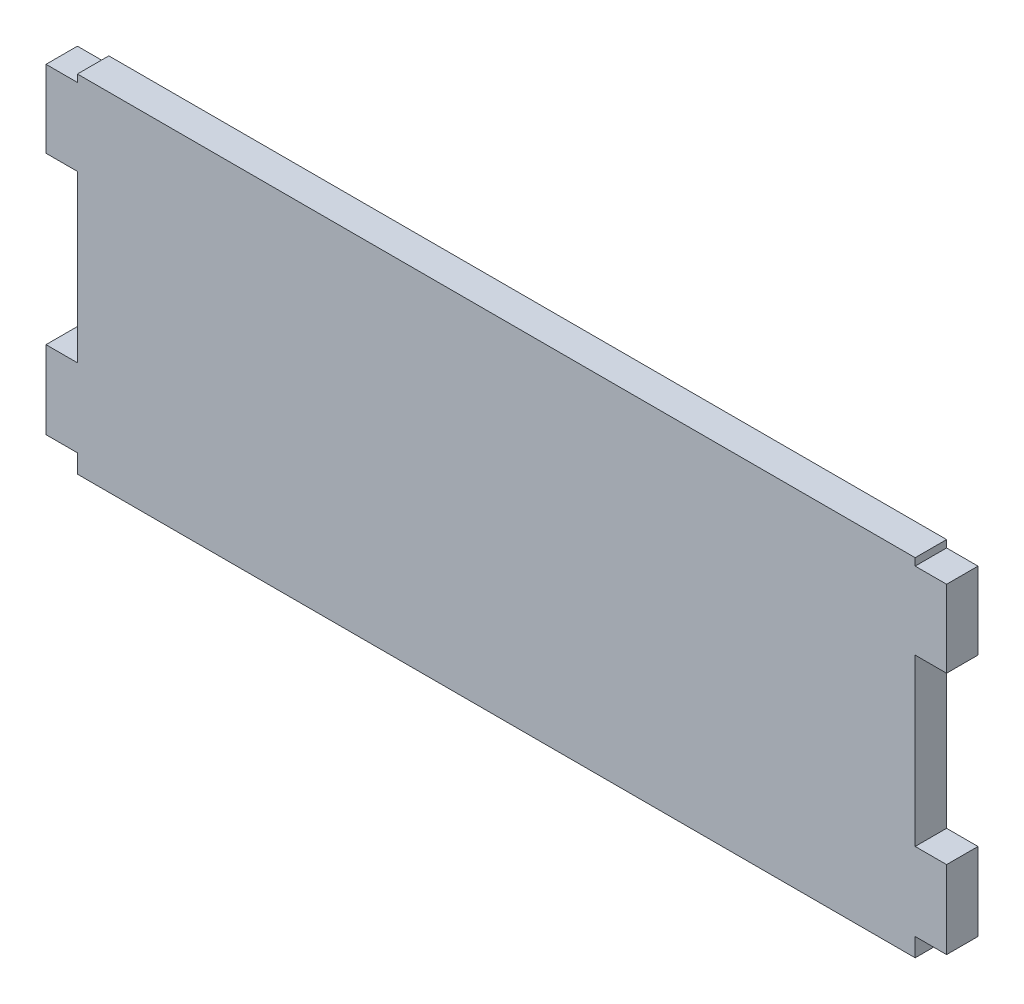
ISO-10303-21;
HEADER;
FILE_DESCRIPTION(('STEP AP214'),'2;1');
FILE_NAME('part.step','',(''),(''),'','','');
FILE_SCHEMA(('AUTOMOTIVE_DESIGN { 1 0 10303 214 1 1 1 1 }'));
ENDSEC;
DATA;
#1=APPLICATION_CONTEXT('core data for automotive mechanical design processes');
#2=APPLICATION_PROTOCOL_DEFINITION('international standard','automotive_design',2000,#1);
#3=PRODUCT_CONTEXT('',#1,'mechanical');
#4=PRODUCT('Part','Part','',(#3));
#5=PRODUCT_RELATED_PRODUCT_CATEGORY('part','',(#4));
#6=PRODUCT_DEFINITION_FORMATION('','',#4);
#7=PRODUCT_DEFINITION_CONTEXT('part definition',#1,'design');
#8=PRODUCT_DEFINITION('design','',#6,#7);
#9=PRODUCT_DEFINITION_SHAPE('','',#8);
#10=(LENGTH_UNIT() NAMED_UNIT(*) SI_UNIT(.MILLI.,.METRE.));
#11=(NAMED_UNIT(*) PLANE_ANGLE_UNIT() SI_UNIT($,.RADIAN.));
#12=(NAMED_UNIT(*) SI_UNIT($,.STERADIAN.) SOLID_ANGLE_UNIT());
#13=UNCERTAINTY_MEASURE_WITH_UNIT(LENGTH_MEASURE(1.E-05),#10,'distance_accuracy_value','');
#14=(GEOMETRIC_REPRESENTATION_CONTEXT(3) GLOBAL_UNCERTAINTY_ASSIGNED_CONTEXT((#13)) GLOBAL_UNIT_ASSIGNED_CONTEXT((#10,
#11,#12)) REPRESENTATION_CONTEXT('',''));
#15=CARTESIAN_POINT('',(0.,0.,0.));
#16=DIRECTION('',(0.,0.,1.));
#17=DIRECTION('',(1.,0.,0.));
#18=AXIS2_PLACEMENT_3D('',#15,#16,#17);
#19=CARTESIAN_POINT('',(80.,-4.59136911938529,3.));
#20=DIRECTION('',(-1.,0.,0.));
#21=DIRECTION('',(0.,0.,1.));
#22=AXIS2_PLACEMENT_3D('',#19,#20,#21);
#23=PLANE('',#22);
#24=DIRECTION('',(0.,1.,0.));
#25=VECTOR('',#24,1.);
#26=CARTESIAN_POINT('',(80.,-4.59136911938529,3.));
#27=LINE('',#26,#25);
#28=CARTESIAN_POINT('',(80.,-5.28863512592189,3.));
#29=VERTEX_POINT('',#28);
#30=CARTESIAN_POINT('',(80.,-4.59136911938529,3.));
#31=VERTEX_POINT('',#30);
#32=EDGE_CURVE('E37',#29,#31,#27,.T.);
#33=ORIENTED_EDGE('',*,*,#32,.F.);
#34=DIRECTION('',(0.,0.,1.));
#35=VECTOR('',#34,1.);
#36=CARTESIAN_POINT('',(80.,-5.28863512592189,0.));
#37=LINE('',#36,#35);
#38=CARTESIAN_POINT('',(80.,-5.28863512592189,0.));
#39=VERTEX_POINT('',#38);
#40=EDGE_CURVE('E185',#39,#29,#37,.T.);
#41=ORIENTED_EDGE('',*,*,#40,.F.);
#42=DIRECTION('',(0.,1.,0.));
#43=VECTOR('',#42,1.);
#44=CARTESIAN_POINT('',(80.,-4.59136911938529,0.));
#45=LINE('',#44,#43);
#46=CARTESIAN_POINT('',(80.,-4.59136911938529,0.));
#47=VERTEX_POINT('',#46);
#48=EDGE_CURVE('E174',#39,#47,#45,.T.);
#49=ORIENTED_EDGE('',*,*,#48,.T.);
#50=DIRECTION('',(0.,0.,-1.));
#51=VECTOR('',#50,1.);
#52=CARTESIAN_POINT('',(80.,-4.59136911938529,3.));
#53=LINE('',#52,#51);
#54=EDGE_CURVE('E314',#31,#47,#53,.T.);
#55=ORIENTED_EDGE('',*,*,#54,.F.);
#56=EDGE_LOOP('',(#33,#41,#49,#55));
#57=FACE_BOUND('',#56,.T.);
#58=ADVANCED_FACE('F33',(#57),#23,.F.);
#59=CARTESIAN_POINT('',(80.,-28.4735574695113,0.));
#60=VERTEX_POINT('',#59);
#61=CARTESIAN_POINT('',(80.,-12.6479913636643,0.));
#62=VERTEX_POINT('',#61);
#63=EDGE_CURVE('E183',#60,#62,#45,.T.);
#64=ORIENTED_EDGE('',*,*,#63,.T.);
#65=DIRECTION('',(0.,0.,1.));
#66=VECTOR('',#65,1.);
#67=CARTESIAN_POINT('',(80.,-12.6479913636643,0.));
#68=LINE('',#67,#66);
#69=CARTESIAN_POINT('',(80.,-12.6479913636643,3.));
#70=VERTEX_POINT('',#69);
#71=EDGE_CURVE('E58',#62,#70,#68,.T.);
#72=ORIENTED_EDGE('',*,*,#71,.T.);
#73=CARTESIAN_POINT('',(80.,-28.4735574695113,3.));
#74=VERTEX_POINT('',#73);
#75=EDGE_CURVE('E297',#74,#70,#27,.T.);
#76=ORIENTED_EDGE('',*,*,#75,.F.);
#77=DIRECTION('',(0.,0.,1.));
#78=VECTOR('',#77,1.);
#79=CARTESIAN_POINT('',(80.,-28.4735574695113,0.));
#80=LINE('',#79,#78);
#81=EDGE_CURVE('E215',#60,#74,#80,.T.);
#82=ORIENTED_EDGE('',*,*,#81,.F.);
#83=EDGE_LOOP('',(#64,#72,#76,#82));
#84=FACE_BOUND('',#83,.T.);
#85=ADVANCED_FACE('F329',(#84),#23,.F.);
#86=CARTESIAN_POINT('',(0.,-4.59136911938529,3.));
#87=DIRECTION('',(1.,0.,0.));
#88=DIRECTION('',(0.,0.,-1.));
#89=AXIS2_PLACEMENT_3D('',#86,#87,#88);
#90=PLANE('',#89);
#91=DIRECTION('',(0.,-1.,0.));
#92=VECTOR('',#91,1.);
#93=CARTESIAN_POINT('',(0.,-4.59136911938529,3.));
#94=LINE('',#93,#92);
#95=CARTESIAN_POINT('',(0.,-35.9200211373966,3.));
#96=VERTEX_POINT('',#95);
#97=CARTESIAN_POINT('',(0.,-37.6851798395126,3.));
#98=VERTEX_POINT('',#97);
#99=EDGE_CURVE('E263',#96,#98,#94,.T.);
#100=ORIENTED_EDGE('',*,*,#99,.F.);
#101=DIRECTION('',(0.,0.,1.));
#102=VECTOR('',#101,1.);
#103=CARTESIAN_POINT('',(0.,-35.9200211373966,0.));
#104=LINE('',#103,#102);
#105=CARTESIAN_POINT('',(0.,-35.9200211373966,0.));
#106=VERTEX_POINT('',#105);
#107=EDGE_CURVE('E374',#106,#96,#104,.T.);
#108=ORIENTED_EDGE('',*,*,#107,.F.);
#109=DIRECTION('',(0.,-1.,0.));
#110=VECTOR('',#109,1.);
#111=CARTESIAN_POINT('',(0.,-4.59136911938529,0.));
#112=LINE('',#111,#110);
#113=CARTESIAN_POINT('',(0.,-37.6851798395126,0.));
#114=VERTEX_POINT('',#113);
#115=EDGE_CURVE('E267',#106,#114,#112,.T.);
#116=ORIENTED_EDGE('',*,*,#115,.T.);
#117=DIRECTION('',(0.,0.,-1.));
#118=VECTOR('',#117,1.);
#119=CARTESIAN_POINT('',(0.,-37.6851798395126,3.));
#120=LINE('',#119,#118);
#121=EDGE_CURVE('E11',#98,#114,#120,.T.);
#122=ORIENTED_EDGE('',*,*,#121,.F.);
#123=EDGE_LOOP('',(#100,#108,#116,#122));
#124=FACE_BOUND('',#123,.T.);
#125=ADVANCED_FACE('F349',(#124),#90,.F.);
#126=CARTESIAN_POINT('',(0.,-12.6479913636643,0.));
#127=VERTEX_POINT('',#126);
#128=CARTESIAN_POINT('',(0.,-28.4735574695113,0.));
#129=VERTEX_POINT('',#128);
#130=EDGE_CURVE('E283',#127,#129,#112,.T.);
#131=ORIENTED_EDGE('',*,*,#130,.T.);
#132=DIRECTION('',(0.,0.,1.));
#133=VECTOR('',#132,1.);
#134=CARTESIAN_POINT('',(0.,-28.4735574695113,0.));
#135=LINE('',#134,#133);
#136=CARTESIAN_POINT('',(0.,-28.4735574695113,3.));
#137=VERTEX_POINT('',#136);
#138=EDGE_CURVE('E399',#129,#137,#135,.T.);
#139=ORIENTED_EDGE('',*,*,#138,.T.);
#140=CARTESIAN_POINT('',(0.,-12.6479913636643,3.));
#141=VERTEX_POINT('',#140);
#142=EDGE_CURVE('E266',#141,#137,#94,.T.);
#143=ORIENTED_EDGE('',*,*,#142,.F.);
#144=DIRECTION('',(0.,0.,1.));
#145=VECTOR('',#144,1.);
#146=CARTESIAN_POINT('',(0.,-12.6479913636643,0.));
#147=LINE('',#146,#145);
#148=EDGE_CURVE('E414',#127,#141,#147,.T.);
#149=ORIENTED_EDGE('',*,*,#148,.F.);
#150=EDGE_LOOP('',(#131,#139,#143,#149));
#151=FACE_BOUND('',#150,.T.);
#152=ADVANCED_FACE('F361',(#151),#90,.F.);
#153=CARTESIAN_POINT('',(0.,-4.59136911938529,0.));
#154=VERTEX_POINT('',#153);
#155=CARTESIAN_POINT('',(0.,-5.28863512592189,0.));
#156=VERTEX_POINT('',#155);
#157=EDGE_CURVE('E285',#154,#156,#112,.T.);
#158=ORIENTED_EDGE('',*,*,#157,.T.);
#159=DIRECTION('',(0.,0.,1.));
#160=VECTOR('',#159,1.);
#161=CARTESIAN_POINT('',(0.,-5.28863512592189,0.));
#162=LINE('',#161,#160);
#163=CARTESIAN_POINT('',(0.,-5.28863512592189,3.));
#164=VERTEX_POINT('',#163);
#165=EDGE_CURVE('E420',#156,#164,#162,.T.);
#166=ORIENTED_EDGE('',*,*,#165,.T.);
#167=CARTESIAN_POINT('',(0.,-4.59136911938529,3.));
#168=VERTEX_POINT('',#167);
#169=EDGE_CURVE('E280',#168,#164,#94,.T.);
#170=ORIENTED_EDGE('',*,*,#169,.F.);
#171=DIRECTION('',(0.,0.,-1.));
#172=VECTOR('',#171,1.);
#173=CARTESIAN_POINT('',(0.,-4.59136911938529,3.));
#174=LINE('',#173,#172);
#175=EDGE_CURVE('E291',#168,#154,#174,.T.);
#176=ORIENTED_EDGE('',*,*,#175,.T.);
#177=EDGE_LOOP('',(#158,#166,#170,#176));
#178=FACE_BOUND('',#177,.T.);
#179=ADVANCED_FACE('F35',(#178),#90,.F.);
#180=CARTESIAN_POINT('',(0.,-37.6851798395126,3.));
#181=DIRECTION('',(0.,1.,0.));
#182=DIRECTION('',(0.,0.,1.));
#183=AXIS2_PLACEMENT_3D('',#180,#181,#182);
#184=PLANE('',#183);
#185=DIRECTION('',(1.,0.,0.));
#186=VECTOR('',#185,1.);
#187=CARTESIAN_POINT('',(0.,-37.6851798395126,0.));
#188=LINE('',#187,#186);
#189=CARTESIAN_POINT('',(80.,-37.6851798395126,0.));
#190=VERTEX_POINT('',#189);
#191=EDGE_CURVE('E184',#114,#190,#188,.T.);
#192=ORIENTED_EDGE('',*,*,#191,.T.);
#193=DIRECTION('',(0.,0.,-1.));
#194=VECTOR('',#193,1.);
#195=CARTESIAN_POINT('',(80.,-37.6851798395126,3.));
#196=LINE('',#195,#194);
#197=CARTESIAN_POINT('',(80.,-37.6851798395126,3.));
#198=VERTEX_POINT('',#197);
#199=EDGE_CURVE('E43',#198,#190,#196,.T.);
#200=ORIENTED_EDGE('',*,*,#199,.F.);
#201=DIRECTION('',(1.,0.,0.));
#202=VECTOR('',#201,1.);
#203=CARTESIAN_POINT('',(0.,-37.6851798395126,3.));
#204=LINE('',#203,#202);
#205=EDGE_CURVE('E274',#98,#198,#204,.T.);
#206=ORIENTED_EDGE('',*,*,#205,.F.);
#207=ORIENTED_EDGE('',*,*,#121,.T.);
#208=EDGE_LOOP('',(#192,#200,#206,#207));
#209=FACE_BOUND('',#208,.T.);
#210=ADVANCED_FACE('F310',(#209),#184,.F.);
#211=CARTESIAN_POINT('',(80.,-35.9200211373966,0.));
#212=VERTEX_POINT('',#211);
#213=EDGE_CURVE('E260',#190,#212,#45,.T.);
#214=ORIENTED_EDGE('',*,*,#213,.T.);
#215=DIRECTION('',(0.,0.,1.));
#216=VECTOR('',#215,1.);
#217=CARTESIAN_POINT('',(80.,-35.9200211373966,0.));
#218=LINE('',#217,#216);
#219=CARTESIAN_POINT('',(80.,-35.9200211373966,3.));
#220=VERTEX_POINT('',#219);
#221=EDGE_CURVE('E227',#212,#220,#218,.T.);
#222=ORIENTED_EDGE('',*,*,#221,.T.);
#223=EDGE_CURVE('E292',#198,#220,#27,.T.);
#224=ORIENTED_EDGE('',*,*,#223,.F.);
#225=ORIENTED_EDGE('',*,*,#199,.T.);
#226=EDGE_LOOP('',(#214,#222,#224,#225));
#227=FACE_BOUND('',#226,.T.);
#228=ADVANCED_FACE('F316',(#227),#23,.F.);
#229=CARTESIAN_POINT('',(0.,-4.59136911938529,3.));
#230=DIRECTION('',(0.,-1.,0.));
#231=DIRECTION('',(0.,0.,-1.));
#232=AXIS2_PLACEMENT_3D('',#229,#230,#231);
#233=PLANE('',#232);
#234=DIRECTION('',(-1.,0.,0.));
#235=VECTOR('',#234,1.);
#236=CARTESIAN_POINT('',(0.,-4.59136911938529,0.));
#237=LINE('',#236,#235);
#238=EDGE_CURVE('E181',#47,#154,#237,.T.);
#239=ORIENTED_EDGE('',*,*,#238,.T.);
#240=ORIENTED_EDGE('',*,*,#175,.F.);
#241=DIRECTION('',(-1.,0.,0.));
#242=VECTOR('',#241,1.);
#243=CARTESIAN_POINT('',(0.,-4.59136911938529,3.));
#244=LINE('',#243,#242);
#245=EDGE_CURVE('E288',#31,#168,#244,.T.);
#246=ORIENTED_EDGE('',*,*,#245,.F.);
#247=ORIENTED_EDGE('',*,*,#54,.T.);
#248=EDGE_LOOP('',(#239,#240,#246,#247));
#249=FACE_BOUND('',#248,.T.);
#250=ADVANCED_FACE('F352',(#249),#233,.F.);
#251=CARTESIAN_POINT('',(0.,0.,3.));
#252=DIRECTION('',(0.,0.,1.));
#253=DIRECTION('',(1.,0.,0.));
#254=AXIS2_PLACEMENT_3D('',#251,#252,#253);
#255=PLANE('',#254);
#256=ORIENTED_EDGE('',*,*,#169,.T.);
#257=DIRECTION('',(-1.,0.,0.));
#258=VECTOR('',#257,1.);
#259=CARTESIAN_POINT('',(0.,-5.28863512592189,3.));
#260=LINE('',#259,#258);
#261=CARTESIAN_POINT('',(-3.,-5.28863512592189,3.));
#262=VERTEX_POINT('',#261);
#263=EDGE_CURVE('E382',#164,#262,#260,.T.);
#264=ORIENTED_EDGE('',*,*,#263,.T.);
#265=DIRECTION('',(0.,-1.,0.));
#266=VECTOR('',#265,1.);
#267=CARTESIAN_POINT('',(-3.,-5.28863512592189,3.));
#268=LINE('',#267,#266);
#269=CARTESIAN_POINT('',(-3.,-12.6479913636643,3.));
#270=VERTEX_POINT('',#269);
#271=EDGE_CURVE('E406',#262,#270,#268,.T.);
#272=ORIENTED_EDGE('',*,*,#271,.T.);
#273=DIRECTION('',(1.,0.,0.));
#274=VECTOR('',#273,1.);
#275=CARTESIAN_POINT('',(0.,-12.6479913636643,3.));
#276=LINE('',#275,#274);
#277=EDGE_CURVE('E409',#270,#141,#276,.T.);
#278=ORIENTED_EDGE('',*,*,#277,.T.);
#279=ORIENTED_EDGE('',*,*,#142,.T.);
#280=DIRECTION('',(-1.,0.,0.));
#281=VECTOR('',#280,1.);
#282=CARTESIAN_POINT('',(0.,-28.4735574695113,3.));
#283=LINE('',#282,#281);
#284=CARTESIAN_POINT('',(-3.,-28.4735574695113,3.));
#285=VERTEX_POINT('',#284);
#286=EDGE_CURVE('E224',#137,#285,#283,.T.);
#287=ORIENTED_EDGE('',*,*,#286,.T.);
#288=DIRECTION('',(0.,-1.,0.));
#289=VECTOR('',#288,1.);
#290=CARTESIAN_POINT('',(-3.,-28.4735574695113,3.));
#291=LINE('',#290,#289);
#292=CARTESIAN_POINT('',(-3.,-35.9200211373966,3.));
#293=VERTEX_POINT('',#292);
#294=EDGE_CURVE('E388',#285,#293,#291,.T.);
#295=ORIENTED_EDGE('',*,*,#294,.T.);
#296=DIRECTION('',(1.,0.,0.));
#297=VECTOR('',#296,1.);
#298=CARTESIAN_POINT('',(0.,-35.9200211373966,3.));
#299=LINE('',#298,#297);
#300=EDGE_CURVE('E379',#293,#96,#299,.T.);
#301=ORIENTED_EDGE('',*,*,#300,.T.);
#302=ORIENTED_EDGE('',*,*,#99,.T.);
#303=ORIENTED_EDGE('',*,*,#205,.T.);
#304=ORIENTED_EDGE('',*,*,#223,.T.);
#305=DIRECTION('',(1.,0.,0.));
#306=VECTOR('',#305,1.);
#307=CARTESIAN_POINT('',(80.,-35.9200211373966,3.));
#308=LINE('',#307,#306);
#309=CARTESIAN_POINT('',(83.,-35.9200211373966,3.));
#310=VERTEX_POINT('',#309);
#311=EDGE_CURVE('E221',#220,#310,#308,.T.);
#312=ORIENTED_EDGE('',*,*,#311,.T.);
#313=DIRECTION('',(0.,1.,0.));
#314=VECTOR('',#313,1.);
#315=CARTESIAN_POINT('',(83.,-28.4735574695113,3.));
#316=LINE('',#315,#314);
#317=CARTESIAN_POINT('',(83.,-28.4735574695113,3.));
#318=VERTEX_POINT('',#317);
#319=EDGE_CURVE('E217',#310,#318,#316,.T.);
#320=ORIENTED_EDGE('',*,*,#319,.T.);
#321=DIRECTION('',(-1.,0.,0.));
#322=VECTOR('',#321,1.);
#323=CARTESIAN_POINT('',(80.,-28.4735574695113,3.));
#324=LINE('',#323,#322);
#325=EDGE_CURVE('E208',#318,#74,#324,.T.);
#326=ORIENTED_EDGE('',*,*,#325,.T.);
#327=ORIENTED_EDGE('',*,*,#75,.T.);
#328=DIRECTION('',(1.,0.,0.));
#329=VECTOR('',#328,1.);
#330=CARTESIAN_POINT('',(80.,-12.6479913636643,3.));
#331=LINE('',#330,#329);
#332=CARTESIAN_POINT('',(83.,-12.6479913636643,3.));
#333=VERTEX_POINT('',#332);
#334=EDGE_CURVE('E199',#70,#333,#331,.T.);
#335=ORIENTED_EDGE('',*,*,#334,.T.);
#336=DIRECTION('',(0.,1.,0.));
#337=VECTOR('',#336,1.);
#338=CARTESIAN_POINT('',(83.,-5.28863512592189,3.));
#339=LINE('',#338,#337);
#340=CARTESIAN_POINT('',(83.,-5.28863512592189,3.));
#341=VERTEX_POINT('',#340);
#342=EDGE_CURVE('E194',#333,#341,#339,.T.);
#343=ORIENTED_EDGE('',*,*,#342,.T.);
#344=DIRECTION('',(-1.,0.,0.));
#345=VECTOR('',#344,1.);
#346=CARTESIAN_POINT('',(80.,-5.28863512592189,3.));
#347=LINE('',#346,#345);
#348=EDGE_CURVE('E203',#341,#29,#347,.T.);
#349=ORIENTED_EDGE('',*,*,#348,.T.);
#350=ORIENTED_EDGE('',*,*,#32,.T.);
#351=ORIENTED_EDGE('',*,*,#245,.T.);
#352=EDGE_LOOP('',(#256,#264,#272,#278,#279,#287,#295,#301,#302,#303,#304,#312,#320,#326,#327,
#335,#343,#349,#350,#351));
#353=FACE_BOUND('',#352,.T.);
#354=ADVANCED_FACE('F305',(#353),#255,.T.);
#355=CARTESIAN_POINT('',(0.,0.,0.));
#356=DIRECTION('',(0.,0.,1.));
#357=DIRECTION('',(1.,0.,0.));
#358=AXIS2_PLACEMENT_3D('',#355,#356,#357);
#359=PLANE('',#358);
#360=ORIENTED_EDGE('',*,*,#157,.F.);
#361=ORIENTED_EDGE('',*,*,#238,.F.);
#362=ORIENTED_EDGE('',*,*,#48,.F.);
#363=DIRECTION('',(-1.,0.,0.));
#364=VECTOR('',#363,1.);
#365=CARTESIAN_POINT('',(80.,-5.28863512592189,0.));
#366=LINE('',#365,#364);
#367=CARTESIAN_POINT('',(83.,-5.28863512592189,0.));
#368=VERTEX_POINT('',#367);
#369=EDGE_CURVE('E179',#368,#39,#366,.T.);
#370=ORIENTED_EDGE('',*,*,#369,.F.);
#371=DIRECTION('',(0.,1.,0.));
#372=VECTOR('',#371,1.);
#373=CARTESIAN_POINT('',(83.,-5.28863512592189,0.));
#374=LINE('',#373,#372);
#375=CARTESIAN_POINT('',(83.,-12.6479913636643,0.));
#376=VERTEX_POINT('',#375);
#377=EDGE_CURVE('E189',#376,#368,#374,.T.);
#378=ORIENTED_EDGE('',*,*,#377,.F.);
#379=DIRECTION('',(1.,0.,0.));
#380=VECTOR('',#379,1.);
#381=CARTESIAN_POINT('',(80.,-12.6479913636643,0.));
#382=LINE('',#381,#380);
#383=EDGE_CURVE('E193',#62,#376,#382,.T.);
#384=ORIENTED_EDGE('',*,*,#383,.F.);
#385=ORIENTED_EDGE('',*,*,#63,.F.);
#386=DIRECTION('',(-1.,0.,0.));
#387=VECTOR('',#386,1.);
#388=CARTESIAN_POINT('',(80.,-28.4735574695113,0.));
#389=LINE('',#388,#387);
#390=CARTESIAN_POINT('',(83.,-28.4735574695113,0.));
#391=VERTEX_POINT('',#390);
#392=EDGE_CURVE('E220',#391,#60,#389,.T.);
#393=ORIENTED_EDGE('',*,*,#392,.F.);
#394=DIRECTION('',(0.,1.,0.));
#395=VECTOR('',#394,1.);
#396=CARTESIAN_POINT('',(83.,-28.4735574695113,0.));
#397=LINE('',#396,#395);
#398=CARTESIAN_POINT('',(83.,-35.9200211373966,0.));
#399=VERTEX_POINT('',#398);
#400=EDGE_CURVE('E212',#399,#391,#397,.T.);
#401=ORIENTED_EDGE('',*,*,#400,.F.);
#402=DIRECTION('',(1.,0.,0.));
#403=VECTOR('',#402,1.);
#404=CARTESIAN_POINT('',(80.,-35.9200211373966,0.));
#405=LINE('',#404,#403);
#406=EDGE_CURVE('E216',#212,#399,#405,.T.);
#407=ORIENTED_EDGE('',*,*,#406,.F.);
#408=ORIENTED_EDGE('',*,*,#213,.F.);
#409=ORIENTED_EDGE('',*,*,#191,.F.);
#410=ORIENTED_EDGE('',*,*,#115,.F.);
#411=DIRECTION('',(1.,0.,0.));
#412=VECTOR('',#411,1.);
#413=CARTESIAN_POINT('',(0.,-35.9200211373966,0.));
#414=LINE('',#413,#412);
#415=CARTESIAN_POINT('',(-3.,-35.9200211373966,0.));
#416=VERTEX_POINT('',#415);
#417=EDGE_CURVE('E381',#416,#106,#414,.T.);
#418=ORIENTED_EDGE('',*,*,#417,.F.);
#419=DIRECTION('',(0.,-1.,0.));
#420=VECTOR('',#419,1.);
#421=CARTESIAN_POINT('',(-3.,-28.4735574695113,0.));
#422=LINE('',#421,#420);
#423=CARTESIAN_POINT('',(-3.,-28.4735574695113,0.));
#424=VERTEX_POINT('',#423);
#425=EDGE_CURVE('E392',#424,#416,#422,.T.);
#426=ORIENTED_EDGE('',*,*,#425,.F.);
#427=DIRECTION('',(-1.,0.,0.));
#428=VECTOR('',#427,1.);
#429=CARTESIAN_POINT('',(0.,-28.4735574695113,0.));
#430=LINE('',#429,#428);
#431=EDGE_CURVE('E389',#129,#424,#430,.T.);
#432=ORIENTED_EDGE('',*,*,#431,.F.);
#433=ORIENTED_EDGE('',*,*,#130,.F.);
#434=DIRECTION('',(1.,0.,0.));
#435=VECTOR('',#434,1.);
#436=CARTESIAN_POINT('',(0.,-12.6479913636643,0.));
#437=LINE('',#436,#435);
#438=CARTESIAN_POINT('',(-3.,-12.6479913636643,0.));
#439=VERTEX_POINT('',#438);
#440=EDGE_CURVE('E404',#439,#127,#437,.T.);
#441=ORIENTED_EDGE('',*,*,#440,.F.);
#442=DIRECTION('',(0.,-1.,0.));
#443=VECTOR('',#442,1.);
#444=CARTESIAN_POINT('',(-3.,-5.28863512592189,0.));
#445=LINE('',#444,#443);
#446=CARTESIAN_POINT('',(-3.,-5.28863512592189,0.));
#447=VERTEX_POINT('',#446);
#448=EDGE_CURVE('E401',#447,#439,#445,.T.);
#449=ORIENTED_EDGE('',*,*,#448,.F.);
#450=DIRECTION('',(-1.,0.,0.));
#451=VECTOR('',#450,1.);
#452=CARTESIAN_POINT('',(0.,-5.28863512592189,0.));
#453=LINE('',#452,#451);
#454=EDGE_CURVE('E405',#156,#447,#453,.T.);
#455=ORIENTED_EDGE('',*,*,#454,.F.);
#456=EDGE_LOOP('',(#360,#361,#362,#370,#378,#384,#385,#393,#401,#407,#408,#409,#410,#418,#426,
#432,#433,#441,#449,#455));
#457=FACE_BOUND('',#456,.T.);
#458=ADVANCED_FACE('F176',(#457),#359,.F.);
#459=CARTESIAN_POINT('',(0.,-12.6479913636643,0.));
#460=DIRECTION('',(0.,-1.,0.));
#461=DIRECTION('',(0.,0.,-1.));
#462=AXIS2_PLACEMENT_3D('',#459,#460,#461);
#463=PLANE('',#462);
#464=ORIENTED_EDGE('',*,*,#277,.F.);
#465=DIRECTION('',(0.,0.,1.));
#466=VECTOR('',#465,1.);
#467=CARTESIAN_POINT('',(-3.,-12.6479913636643,0.));
#468=LINE('',#467,#466);
#469=EDGE_CURVE('E412',#439,#270,#468,.T.);
#470=ORIENTED_EDGE('',*,*,#469,.F.);
#471=ORIENTED_EDGE('',*,*,#440,.T.);
#472=ORIENTED_EDGE('',*,*,#148,.T.);
#473=EDGE_LOOP('',(#464,#470,#471,#472));
#474=FACE_BOUND('',#473,.T.);
#475=ADVANCED_FACE('F448',(#474),#463,.T.);
#476=CARTESIAN_POINT('',(-3.,-5.28863512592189,0.));
#477=DIRECTION('',(-1.,0.,0.));
#478=DIRECTION('',(0.,0.,1.));
#479=AXIS2_PLACEMENT_3D('',#476,#477,#478);
#480=PLANE('',#479);
#481=ORIENTED_EDGE('',*,*,#271,.F.);
#482=DIRECTION('',(0.,0.,1.));
#483=VECTOR('',#482,1.);
#484=CARTESIAN_POINT('',(-3.,-5.28863512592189,0.));
#485=LINE('',#484,#483);
#486=EDGE_CURVE('E434',#447,#262,#485,.T.);
#487=ORIENTED_EDGE('',*,*,#486,.F.);
#488=ORIENTED_EDGE('',*,*,#448,.T.);
#489=ORIENTED_EDGE('',*,*,#469,.T.);
#490=EDGE_LOOP('',(#481,#487,#488,#489));
#491=FACE_BOUND('',#490,.T.);
#492=ADVANCED_FACE('F446',(#491),#480,.T.);
#493=CARTESIAN_POINT('',(0.,-5.28863512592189,0.));
#494=DIRECTION('',(0.,1.,0.));
#495=DIRECTION('',(0.,0.,1.));
#496=AXIS2_PLACEMENT_3D('',#493,#494,#495);
#497=PLANE('',#496);
#498=ORIENTED_EDGE('',*,*,#263,.F.);
#499=ORIENTED_EDGE('',*,*,#165,.F.);
#500=ORIENTED_EDGE('',*,*,#454,.T.);
#501=ORIENTED_EDGE('',*,*,#486,.T.);
#502=EDGE_LOOP('',(#498,#499,#500,#501));
#503=FACE_BOUND('',#502,.T.);
#504=ADVANCED_FACE('F439',(#503),#497,.T.);
#505=CARTESIAN_POINT('',(0.,-35.9200211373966,0.));
#506=DIRECTION('',(0.,-1.,0.));
#507=DIRECTION('',(0.,0.,-1.));
#508=AXIS2_PLACEMENT_3D('',#505,#506,#507);
#509=PLANE('',#508);
#510=ORIENTED_EDGE('',*,*,#300,.F.);
#511=DIRECTION('',(0.,0.,1.));
#512=VECTOR('',#511,1.);
#513=CARTESIAN_POINT('',(-3.,-35.9200211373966,0.));
#514=LINE('',#513,#512);
#515=EDGE_CURVE('E383',#416,#293,#514,.T.);
#516=ORIENTED_EDGE('',*,*,#515,.F.);
#517=ORIENTED_EDGE('',*,*,#417,.T.);
#518=ORIENTED_EDGE('',*,*,#107,.T.);
#519=EDGE_LOOP('',(#510,#516,#517,#518));
#520=FACE_BOUND('',#519,.T.);
#521=ADVANCED_FACE('F378',(#520),#509,.T.);
#522=CARTESIAN_POINT('',(-3.,-28.4735574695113,0.));
#523=DIRECTION('',(-1.,0.,0.));
#524=DIRECTION('',(0.,-1.,0.));
#525=AXIS2_PLACEMENT_3D('',#522,#523,#524);
#526=PLANE('',#525);
#527=ORIENTED_EDGE('',*,*,#294,.F.);
#528=DIRECTION('',(0.,0.,1.));
#529=VECTOR('',#528,1.);
#530=CARTESIAN_POINT('',(-3.,-28.4735574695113,0.));
#531=LINE('',#530,#529);
#532=EDGE_CURVE('E397',#424,#285,#531,.T.);
#533=ORIENTED_EDGE('',*,*,#532,.F.);
#534=ORIENTED_EDGE('',*,*,#425,.T.);
#535=ORIENTED_EDGE('',*,*,#515,.T.);
#536=EDGE_LOOP('',(#527,#533,#534,#535));
#537=FACE_BOUND('',#536,.T.);
#538=ADVANCED_FACE('F460',(#537),#526,.T.);
#539=CARTESIAN_POINT('',(0.,-28.4735574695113,0.));
#540=DIRECTION('',(0.,1.,0.));
#541=DIRECTION('',(0.,0.,1.));
#542=AXIS2_PLACEMENT_3D('',#539,#540,#541);
#543=PLANE('',#542);
#544=ORIENTED_EDGE('',*,*,#286,.F.);
#545=ORIENTED_EDGE('',*,*,#138,.F.);
#546=ORIENTED_EDGE('',*,*,#431,.T.);
#547=ORIENTED_EDGE('',*,*,#532,.T.);
#548=EDGE_LOOP('',(#544,#545,#546,#547));
#549=FACE_BOUND('',#548,.T.);
#550=ADVANCED_FACE('F456',(#549),#543,.T.);
#551=CARTESIAN_POINT('',(80.,-28.4735574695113,0.));
#552=DIRECTION('',(0.,1.,0.));
#553=DIRECTION('',(0.,0.,1.));
#554=AXIS2_PLACEMENT_3D('',#551,#552,#553);
#555=PLANE('',#554);
#556=ORIENTED_EDGE('',*,*,#325,.F.);
#557=DIRECTION('',(0.,0.,1.));
#558=VECTOR('',#557,1.);
#559=CARTESIAN_POINT('',(83.,-28.4735574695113,0.));
#560=LINE('',#559,#558);
#561=EDGE_CURVE('E222',#391,#318,#560,.T.);
#562=ORIENTED_EDGE('',*,*,#561,.F.);
#563=ORIENTED_EDGE('',*,*,#392,.T.);
#564=ORIENTED_EDGE('',*,*,#81,.T.);
#565=EDGE_LOOP('',(#556,#562,#563,#564));
#566=FACE_BOUND('',#565,.T.);
#567=ADVANCED_FACE('F467',(#566),#555,.T.);
#568=CARTESIAN_POINT('',(83.,-28.4735574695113,0.));
#569=DIRECTION('',(1.,0.,0.));
#570=DIRECTION('',(0.,0.,-1.));
#571=AXIS2_PLACEMENT_3D('',#568,#569,#570);
#572=PLANE('',#571);
#573=ORIENTED_EDGE('',*,*,#319,.F.);
#574=DIRECTION('',(0.,0.,1.));
#575=VECTOR('',#574,1.);
#576=CARTESIAN_POINT('',(83.,-35.9200211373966,0.));
#577=LINE('',#576,#575);
#578=EDGE_CURVE('E225',#399,#310,#577,.T.);
#579=ORIENTED_EDGE('',*,*,#578,.F.);
#580=ORIENTED_EDGE('',*,*,#400,.T.);
#581=ORIENTED_EDGE('',*,*,#561,.T.);
#582=EDGE_LOOP('',(#573,#579,#580,#581));
#583=FACE_BOUND('',#582,.T.);
#584=ADVANCED_FACE('F325',(#583),#572,.T.);
#585=CARTESIAN_POINT('',(80.,-35.9200211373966,0.));
#586=DIRECTION('',(0.,-1.,0.));
#587=DIRECTION('',(0.,0.,-1.));
#588=AXIS2_PLACEMENT_3D('',#585,#586,#587);
#589=PLANE('',#588);
#590=ORIENTED_EDGE('',*,*,#311,.F.);
#591=ORIENTED_EDGE('',*,*,#221,.F.);
#592=ORIENTED_EDGE('',*,*,#406,.T.);
#593=ORIENTED_EDGE('',*,*,#578,.T.);
#594=EDGE_LOOP('',(#590,#591,#592,#593));
#595=FACE_BOUND('',#594,.T.);
#596=ADVANCED_FACE('F319',(#595),#589,.T.);
#597=CARTESIAN_POINT('',(80.,-5.28863512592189,0.));
#598=DIRECTION('',(0.,1.,0.));
#599=DIRECTION('',(0.,0.,1.));
#600=AXIS2_PLACEMENT_3D('',#597,#598,#599);
#601=PLANE('',#600);
#602=ORIENTED_EDGE('',*,*,#348,.F.);
#603=DIRECTION('',(0.,0.,1.));
#604=VECTOR('',#603,1.);
#605=CARTESIAN_POINT('',(83.,-5.28863512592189,0.));
#606=LINE('',#605,#604);
#607=EDGE_CURVE('E192',#368,#341,#606,.T.);
#608=ORIENTED_EDGE('',*,*,#607,.F.);
#609=ORIENTED_EDGE('',*,*,#369,.T.);
#610=ORIENTED_EDGE('',*,*,#40,.T.);
#611=EDGE_LOOP('',(#602,#608,#609,#610));
#612=FACE_BOUND('',#611,.T.);
#613=ADVANCED_FACE('F191',(#612),#601,.T.);
#614=CARTESIAN_POINT('',(83.,-5.28863512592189,0.));
#615=DIRECTION('',(1.,0.,0.));
#616=DIRECTION('',(0.,0.,-1.));
#617=AXIS2_PLACEMENT_3D('',#614,#615,#616);
#618=PLANE('',#617);
#619=ORIENTED_EDGE('',*,*,#342,.F.);
#620=DIRECTION('',(0.,0.,1.));
#621=VECTOR('',#620,1.);
#622=CARTESIAN_POINT('',(83.,-12.6479913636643,0.));
#623=LINE('',#622,#621);
#624=EDGE_CURVE('E209',#376,#333,#623,.T.);
#625=ORIENTED_EDGE('',*,*,#624,.F.);
#626=ORIENTED_EDGE('',*,*,#377,.T.);
#627=ORIENTED_EDGE('',*,*,#607,.T.);
#628=EDGE_LOOP('',(#619,#625,#626,#627));
#629=FACE_BOUND('',#628,.T.);
#630=ADVANCED_FACE('F335',(#629),#618,.T.);
#631=CARTESIAN_POINT('',(80.,-12.6479913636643,0.));
#632=DIRECTION('',(0.,-1.,0.));
#633=DIRECTION('',(0.,0.,-1.));
#634=AXIS2_PLACEMENT_3D('',#631,#632,#633);
#635=PLANE('',#634);
#636=ORIENTED_EDGE('',*,*,#334,.F.);
#637=ORIENTED_EDGE('',*,*,#71,.F.);
#638=ORIENTED_EDGE('',*,*,#383,.T.);
#639=ORIENTED_EDGE('',*,*,#624,.T.);
#640=EDGE_LOOP('',(#636,#637,#638,#639));
#641=FACE_BOUND('',#640,.T.);
#642=ADVANCED_FACE('F332',(#641),#635,.T.);
#643=CLOSED_SHELL('',(#58,#85,#125,#152,#179,#210,#228,#250,#354,#458,#475,#492,#504,#521,#538,
#550,#567,#584,#596,#613,#630,#642));
#644=MANIFOLD_SOLID_BREP('B2',#643);
#645=ADVANCED_BREP_SHAPE_REPRESENTATION('',(#18,#644),#14);
#646=SHAPE_DEFINITION_REPRESENTATION(#9,#645);
ENDSEC;
END-ISO-10303-21;
